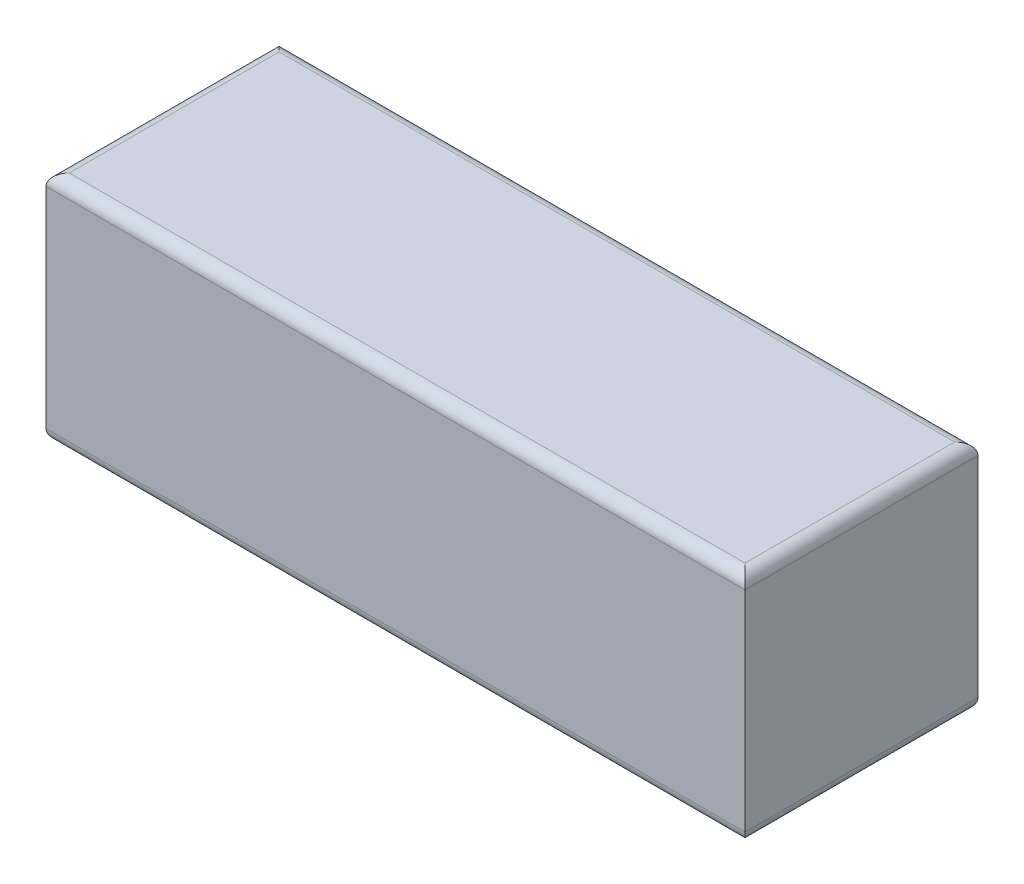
ISO-10303-21;
HEADER;
FILE_DESCRIPTION(('STEP AP214'),'2;1');
FILE_NAME('part.step','',(''),(''),'','','');
FILE_SCHEMA(('AUTOMOTIVE_DESIGN { 1 0 10303 214 1 1 1 1 }'));
ENDSEC;
DATA;
#1=APPLICATION_CONTEXT('core data for automotive mechanical design processes');
#2=APPLICATION_PROTOCOL_DEFINITION('international standard','automotive_design',2000,#1);
#3=PRODUCT_CONTEXT('',#1,'mechanical');
#4=PRODUCT('Part','Part','',(#3));
#5=PRODUCT_RELATED_PRODUCT_CATEGORY('part','',(#4));
#6=PRODUCT_DEFINITION_FORMATION('','',#4);
#7=PRODUCT_DEFINITION_CONTEXT('part definition',#1,'design');
#8=PRODUCT_DEFINITION('design','',#6,#7);
#9=PRODUCT_DEFINITION_SHAPE('','',#8);
#10=(LENGTH_UNIT() NAMED_UNIT(*) SI_UNIT(.MILLI.,.METRE.));
#11=(NAMED_UNIT(*) PLANE_ANGLE_UNIT() SI_UNIT($,.RADIAN.));
#12=(NAMED_UNIT(*) SI_UNIT($,.STERADIAN.) SOLID_ANGLE_UNIT());
#13=UNCERTAINTY_MEASURE_WITH_UNIT(LENGTH_MEASURE(1.E-05),#10,'distance_accuracy_value','');
#14=(GEOMETRIC_REPRESENTATION_CONTEXT(3) GLOBAL_UNCERTAINTY_ASSIGNED_CONTEXT((#13)) GLOBAL_UNIT_ASSIGNED_CONTEXT((#10,
#11,#12)) REPRESENTATION_CONTEXT('',''));
#15=CARTESIAN_POINT('',(0.,0.,0.));
#16=DIRECTION('',(0.,0.,1.));
#17=DIRECTION('',(1.,0.,0.));
#18=AXIS2_PLACEMENT_3D('',#15,#16,#17);
#19=CARTESIAN_POINT('',(0.,20.,0.));
#20=DIRECTION('',(1.,0.,0.));
#21=DIRECTION('',(0.,0.,-1.));
#22=AXIS2_PLACEMENT_3D('',#19,#20,#21);
#23=PLANE('',#22);
#24=DIRECTION('',(0.,-1.,0.));
#25=VECTOR('',#24,1.);
#26=CARTESIAN_POINT('',(0.,20.,-20.));
#27=LINE('',#26,#25);
#28=CARTESIAN_POINT('',(0.,19.,-20.));
#29=VERTEX_POINT('',#28);
#30=CARTESIAN_POINT('',(0.,1.,-20.));
#31=VERTEX_POINT('',#30);
#32=EDGE_CURVE('E158',#29,#31,#27,.T.);
#33=ORIENTED_EDGE('',*,*,#32,.T.);
#34=DIRECTION('',(0.,0.,1.));
#35=VECTOR('',#34,1.);
#36=CARTESIAN_POINT('',(0.,1.,0.));
#37=LINE('',#36,#35);
#38=CARTESIAN_POINT('',(0.,1.,0.));
#39=VERTEX_POINT('',#38);
#40=EDGE_CURVE('E172',#31,#39,#37,.T.);
#41=ORIENTED_EDGE('',*,*,#40,.T.);
#42=DIRECTION('',(0.,-1.,0.));
#43=VECTOR('',#42,1.);
#44=CARTESIAN_POINT('',(0.,20.,0.));
#45=LINE('',#44,#43);
#46=CARTESIAN_POINT('',(0.,19.,0.));
#47=VERTEX_POINT('',#46);
#48=EDGE_CURVE('E129',#47,#39,#45,.T.);
#49=ORIENTED_EDGE('',*,*,#48,.F.);
#50=DIRECTION('',(0.,0.,1.));
#51=VECTOR('',#50,1.);
#52=CARTESIAN_POINT('',(0.,19.,0.));
#53=LINE('',#52,#51);
#54=EDGE_CURVE('E175',#47,#29,#53,.F.);
#55=ORIENTED_EDGE('',*,*,#54,.T.);
#56=EDGE_LOOP('',(#33,#41,#49,#55));
#57=FACE_BOUND('',#56,.T.);
#58=ADVANCED_FACE('F39',(#57),#23,.F.);
#59=CARTESIAN_POINT('',(0.,20.,0.));
#60=DIRECTION('',(0.,0.,-1.));
#61=DIRECTION('',(-1.,0.,0.));
#62=AXIS2_PLACEMENT_3D('',#59,#60,#61);
#63=PLANE('',#62);
#64=ORIENTED_EDGE('',*,*,#48,.T.);
#65=DIRECTION('',(1.,0.,0.));
#66=VECTOR('',#65,1.);
#67=CARTESIAN_POINT('',(60.,1.,0.));
#68=LINE('',#67,#66);
#69=CARTESIAN_POINT('',(60.,1.,0.));
#70=VERTEX_POINT('',#69);
#71=EDGE_CURVE('E127',#39,#70,#68,.T.);
#72=ORIENTED_EDGE('',*,*,#71,.T.);
#73=DIRECTION('',(0.,-1.,0.));
#74=VECTOR('',#73,1.);
#75=CARTESIAN_POINT('',(60.,20.,0.));
#76=LINE('',#75,#74);
#77=CARTESIAN_POINT('',(60.,19.,0.));
#78=VERTEX_POINT('',#77);
#79=EDGE_CURVE('E109',#78,#70,#76,.T.);
#80=ORIENTED_EDGE('',*,*,#79,.F.);
#81=DIRECTION('',(1.,0.,0.));
#82=VECTOR('',#81,1.);
#83=CARTESIAN_POINT('',(0.,19.,0.));
#84=LINE('',#83,#82);
#85=EDGE_CURVE('E124',#78,#47,#84,.F.);
#86=ORIENTED_EDGE('',*,*,#85,.T.);
#87=EDGE_LOOP('',(#64,#72,#80,#86));
#88=FACE_BOUND('',#87,.T.);
#89=ADVANCED_FACE('F123',(#88),#63,.F.);
#90=CARTESIAN_POINT('',(60.,20.,0.));
#91=DIRECTION('',(-1.,0.,0.));
#92=DIRECTION('',(0.,0.,1.));
#93=AXIS2_PLACEMENT_3D('',#90,#91,#92);
#94=PLANE('',#93);
#95=ORIENTED_EDGE('',*,*,#79,.T.);
#96=DIRECTION('',(0.,0.,-1.));
#97=VECTOR('',#96,1.);
#98=CARTESIAN_POINT('',(60.,1.,-20.));
#99=LINE('',#98,#97);
#100=CARTESIAN_POINT('',(60.,1.,-20.));
#101=VERTEX_POINT('',#100);
#102=EDGE_CURVE('E116',#70,#101,#99,.T.);
#103=ORIENTED_EDGE('',*,*,#102,.T.);
#104=DIRECTION('',(0.,-1.,0.));
#105=VECTOR('',#104,1.);
#106=CARTESIAN_POINT('',(60.,20.,-20.));
#107=LINE('',#106,#105);
#108=CARTESIAN_POINT('',(60.,19.,-20.));
#109=VERTEX_POINT('',#108);
#110=EDGE_CURVE('E111',#109,#101,#107,.T.);
#111=ORIENTED_EDGE('',*,*,#110,.F.);
#112=DIRECTION('',(0.,0.,-1.));
#113=VECTOR('',#112,1.);
#114=CARTESIAN_POINT('',(60.,19.,0.));
#115=LINE('',#114,#113);
#116=EDGE_CURVE('E106',#109,#78,#115,.F.);
#117=ORIENTED_EDGE('',*,*,#116,.T.);
#118=EDGE_LOOP('',(#95,#103,#111,#117));
#119=FACE_BOUND('',#118,.T.);
#120=ADVANCED_FACE('F108',(#119),#94,.F.);
#121=CARTESIAN_POINT('',(0.,20.,-20.));
#122=DIRECTION('',(0.,0.,1.));
#123=DIRECTION('',(1.,0.,0.));
#124=AXIS2_PLACEMENT_3D('',#121,#122,#123);
#125=PLANE('',#124);
#126=ORIENTED_EDGE('',*,*,#110,.T.);
#127=DIRECTION('',(-1.,0.,0.));
#128=VECTOR('',#127,1.);
#129=CARTESIAN_POINT('',(0.,1.,-20.));
#130=LINE('',#129,#128);
#131=EDGE_CURVE('E178',#101,#31,#130,.T.);
#132=ORIENTED_EDGE('',*,*,#131,.T.);
#133=ORIENTED_EDGE('',*,*,#32,.F.);
#134=DIRECTION('',(-1.,0.,0.));
#135=VECTOR('',#134,1.);
#136=CARTESIAN_POINT('',(0.,19.,-20.));
#137=LINE('',#136,#135);
#138=EDGE_CURVE('E181',#29,#109,#137,.F.);
#139=ORIENTED_EDGE('',*,*,#138,.T.);
#140=EDGE_LOOP('',(#126,#132,#133,#139));
#141=FACE_BOUND('',#140,.T.);
#142=ADVANCED_FACE('F229',(#141),#125,.F.);
#143=CARTESIAN_POINT('',(0.,20.,0.));
#144=DIRECTION('',(0.,-1.,0.));
#145=DIRECTION('',(0.,0.,-1.));
#146=AXIS2_PLACEMENT_3D('',#143,#144,#145);
#147=PLANE('',#146);
#148=DIRECTION('',(0.,0.,-1.));
#149=VECTOR('',#148,1.);
#150=CARTESIAN_POINT('',(59.,20.,0.));
#151=LINE('',#150,#149);
#152=CARTESIAN_POINT('',(59.,20.,-1.));
#153=VERTEX_POINT('',#152);
#154=CARTESIAN_POINT('',(59.,20.,-19.));
#155=VERTEX_POINT('',#154);
#156=EDGE_CURVE('E49',#153,#155,#151,.T.);
#157=ORIENTED_EDGE('',*,*,#156,.T.);
#158=DIRECTION('',(-1.,0.,0.));
#159=VECTOR('',#158,1.);
#160=CARTESIAN_POINT('',(0.,20.,-19.));
#161=LINE('',#160,#159);
#162=CARTESIAN_POINT('',(1.,20.,-19.));
#163=VERTEX_POINT('',#162);
#164=EDGE_CURVE('E11',#155,#163,#161,.T.);
#165=ORIENTED_EDGE('',*,*,#164,.T.);
#166=DIRECTION('',(0.,0.,1.));
#167=VECTOR('',#166,1.);
#168=CARTESIAN_POINT('',(1.,20.,0.));
#169=LINE('',#168,#167);
#170=CARTESIAN_POINT('',(1.,20.,-1.));
#171=VERTEX_POINT('',#170);
#172=EDGE_CURVE('E169',#163,#171,#169,.T.);
#173=ORIENTED_EDGE('',*,*,#172,.T.);
#174=DIRECTION('',(1.,0.,0.));
#175=VECTOR('',#174,1.);
#176=CARTESIAN_POINT('',(0.,20.,-1.));
#177=LINE('',#176,#175);
#178=EDGE_CURVE('E60',#171,#153,#177,.T.);
#179=ORIENTED_EDGE('',*,*,#178,.T.);
#180=EDGE_LOOP('',(#157,#165,#173,#179));
#181=FACE_BOUND('',#180,.T.);
#182=ADVANCED_FACE('F235',(#181),#147,.F.);
#183=CARTESIAN_POINT('',(0.,0.,0.));
#184=DIRECTION('',(0.,-1.,0.));
#185=DIRECTION('',(0.,0.,-1.));
#186=AXIS2_PLACEMENT_3D('',#183,#184,#185);
#187=PLANE('',#186);
#188=DIRECTION('',(0.,0.,-1.));
#189=VECTOR('',#188,1.);
#190=CARTESIAN_POINT('',(59.,0.,0.));
#191=LINE('',#190,#189);
#192=CARTESIAN_POINT('',(59.,0.,-19.));
#193=VERTEX_POINT('',#192);
#194=CARTESIAN_POINT('',(59.,0.,-1.));
#195=VERTEX_POINT('',#194);
#196=EDGE_CURVE('E189',#193,#195,#191,.F.);
#197=ORIENTED_EDGE('',*,*,#196,.T.);
#198=DIRECTION('',(1.,0.,0.));
#199=VECTOR('',#198,1.);
#200=CARTESIAN_POINT('',(0.,0.,-1.));
#201=LINE('',#200,#199);
#202=CARTESIAN_POINT('',(1.,0.,-1.));
#203=VERTEX_POINT('',#202);
#204=EDGE_CURVE('E117',#195,#203,#201,.F.);
#205=ORIENTED_EDGE('',*,*,#204,.T.);
#206=DIRECTION('',(0.,0.,1.));
#207=VECTOR('',#206,1.);
#208=CARTESIAN_POINT('',(1.,0.,-20.));
#209=LINE('',#208,#207);
#210=CARTESIAN_POINT('',(1.,0.,-19.));
#211=VERTEX_POINT('',#210);
#212=EDGE_CURVE('E195',#203,#211,#209,.F.);
#213=ORIENTED_EDGE('',*,*,#212,.T.);
#214=DIRECTION('',(-1.,0.,0.));
#215=VECTOR('',#214,1.);
#216=CARTESIAN_POINT('',(60.,0.,-19.));
#217=LINE('',#216,#215);
#218=EDGE_CURVE('E192',#211,#193,#217,.F.);
#219=ORIENTED_EDGE('',*,*,#218,.T.);
#220=EDGE_LOOP('',(#197,#205,#213,#219));
#221=FACE_BOUND('',#220,.T.);
#222=ADVANCED_FACE('F237',(#221),#187,.T.);
#223=CARTESIAN_POINT('',(0.,1.,-19.));
#224=DIRECTION('',(1.,0.,0.));
#225=DIRECTION('',(0.,0.,-1.));
#226=AXIS2_PLACEMENT_3D('',#223,#224,#225);
#227=CYLINDRICAL_SURFACE('',#226,1.);
#228=CARTESIAN_POINT('',(59.,1.,-19.));
#229=DIRECTION('',(0.707106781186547,0.,0.707106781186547));
#230=DIRECTION('',(0.707106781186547,0.,-0.707106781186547));
#231=AXIS2_PLACEMENT_3D('',#228,#229,#230);
#232=ELLIPSE('',#231,1.41421356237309,1.);
#233=EDGE_CURVE('E159',#193,#101,#232,.T.);
#234=ORIENTED_EDGE('',*,*,#233,.F.);
#235=ORIENTED_EDGE('',*,*,#218,.F.);
#236=CARTESIAN_POINT('',(1.,1.,-19.));
#237=DIRECTION('',(0.707106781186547,0.,-0.707106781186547));
#238=DIRECTION('',(-0.707106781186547,0.,-0.707106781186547));
#239=AXIS2_PLACEMENT_3D('',#236,#237,#238);
#240=ELLIPSE('',#239,1.41421356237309,1.);
#241=EDGE_CURVE('E154',#31,#211,#240,.F.);
#242=ORIENTED_EDGE('',*,*,#241,.F.);
#243=ORIENTED_EDGE('',*,*,#131,.F.);
#244=EDGE_LOOP('',(#234,#235,#242,#243));
#245=FACE_BOUND('',#244,.T.);
#246=ADVANCED_FACE('F216',(#245),#227,.T.);
#247=CARTESIAN_POINT('',(1.,1.,0.));
#248=DIRECTION('',(0.,0.,-1.));
#249=DIRECTION('',(-1.,0.,0.));
#250=AXIS2_PLACEMENT_3D('',#247,#248,#249);
#251=CYLINDRICAL_SURFACE('',#250,1.);
#252=ORIENTED_EDGE('',*,*,#241,.T.);
#253=ORIENTED_EDGE('',*,*,#212,.F.);
#254=CARTESIAN_POINT('',(1.,1.,-1.));
#255=DIRECTION('',(-0.707106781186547,0.,-0.707106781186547));
#256=DIRECTION('',(0.707106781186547,0.,-0.707106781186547));
#257=AXIS2_PLACEMENT_3D('',#254,#255,#256);
#258=ELLIPSE('',#257,1.41421356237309,1.);
#259=EDGE_CURVE('E143',#39,#203,#258,.F.);
#260=ORIENTED_EDGE('',*,*,#259,.F.);
#261=ORIENTED_EDGE('',*,*,#40,.F.);
#262=EDGE_LOOP('',(#252,#253,#260,#261));
#263=FACE_BOUND('',#262,.T.);
#264=ADVANCED_FACE('F220',(#263),#251,.T.);
#265=CARTESIAN_POINT('',(59.,1.,0.));
#266=DIRECTION('',(0.,0.,1.));
#267=DIRECTION('',(1.,0.,0.));
#268=AXIS2_PLACEMENT_3D('',#265,#266,#267);
#269=CYLINDRICAL_SURFACE('',#268,1.);
#270=ORIENTED_EDGE('',*,*,#233,.T.);
#271=ORIENTED_EDGE('',*,*,#102,.F.);
#272=CARTESIAN_POINT('',(59.,1.,-1.));
#273=DIRECTION('',(-0.707106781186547,0.,0.707106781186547));
#274=DIRECTION('',(0.707106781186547,0.,0.707106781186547));
#275=AXIS2_PLACEMENT_3D('',#272,#273,#274);
#276=ELLIPSE('',#275,1.41421356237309,1.);
#277=EDGE_CURVE('E140',#195,#70,#276,.T.);
#278=ORIENTED_EDGE('',*,*,#277,.F.);
#279=ORIENTED_EDGE('',*,*,#196,.F.);
#280=EDGE_LOOP('',(#270,#271,#278,#279));
#281=FACE_BOUND('',#280,.T.);
#282=ADVANCED_FACE('F228',(#281),#269,.T.);
#283=CARTESIAN_POINT('',(0.,1.,-1.));
#284=DIRECTION('',(-1.,0.,0.));
#285=DIRECTION('',(0.,0.,1.));
#286=AXIS2_PLACEMENT_3D('',#283,#284,#285);
#287=CYLINDRICAL_SURFACE('',#286,1.);
#288=ORIENTED_EDGE('',*,*,#259,.T.);
#289=ORIENTED_EDGE('',*,*,#204,.F.);
#290=ORIENTED_EDGE('',*,*,#277,.T.);
#291=ORIENTED_EDGE('',*,*,#71,.F.);
#292=EDGE_LOOP('',(#288,#289,#290,#291));
#293=FACE_BOUND('',#292,.T.);
#294=ADVANCED_FACE('F223',(#293),#287,.T.);
#295=CARTESIAN_POINT('',(0.,19.,-1.));
#296=DIRECTION('',(1.,0.,0.));
#297=DIRECTION('',(0.,0.,-1.));
#298=AXIS2_PLACEMENT_3D('',#295,#296,#297);
#299=CYLINDRICAL_SURFACE('',#298,1.);
#300=CARTESIAN_POINT('',(1.,19.,-1.));
#301=DIRECTION('',(0.707106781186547,0.,0.707106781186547));
#302=DIRECTION('',(-0.707106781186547,0.,0.707106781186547));
#303=AXIS2_PLACEMENT_3D('',#300,#301,#302);
#304=ELLIPSE('',#303,1.41421356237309,1.);
#305=EDGE_CURVE('E134',#47,#171,#304,.F.);
#306=ORIENTED_EDGE('',*,*,#305,.F.);
#307=ORIENTED_EDGE('',*,*,#85,.F.);
#308=CARTESIAN_POINT('',(59.,19.,-1.));
#309=DIRECTION('',(0.707106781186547,0.,-0.707106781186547));
#310=DIRECTION('',(0.707106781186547,0.,0.707106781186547));
#311=AXIS2_PLACEMENT_3D('',#308,#309,#310);
#312=ELLIPSE('',#311,1.41421356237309,1.);
#313=EDGE_CURVE('E43',#153,#78,#312,.T.);
#314=ORIENTED_EDGE('',*,*,#313,.F.);
#315=ORIENTED_EDGE('',*,*,#178,.F.);
#316=EDGE_LOOP('',(#306,#307,#314,#315));
#317=FACE_BOUND('',#316,.T.);
#318=ADVANCED_FACE('F41',(#317),#299,.T.);
#319=CARTESIAN_POINT('',(59.,19.,0.));
#320=DIRECTION('',(0.,0.,-1.));
#321=DIRECTION('',(-1.,0.,0.));
#322=AXIS2_PLACEMENT_3D('',#319,#320,#321);
#323=CYLINDRICAL_SURFACE('',#322,1.);
#324=ORIENTED_EDGE('',*,*,#313,.T.);
#325=ORIENTED_EDGE('',*,*,#116,.F.);
#326=CARTESIAN_POINT('',(59.,19.,-19.));
#327=DIRECTION('',(-0.707106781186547,0.,-0.707106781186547));
#328=DIRECTION('',(0.707106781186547,0.,-0.707106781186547));
#329=AXIS2_PLACEMENT_3D('',#326,#327,#328);
#330=ELLIPSE('',#329,1.41421356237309,1.);
#331=EDGE_CURVE('E145',#155,#109,#330,.T.);
#332=ORIENTED_EDGE('',*,*,#331,.F.);
#333=ORIENTED_EDGE('',*,*,#156,.F.);
#334=EDGE_LOOP('',(#324,#325,#332,#333));
#335=FACE_BOUND('',#334,.T.);
#336=ADVANCED_FACE('F138',(#335),#323,.T.);
#337=CARTESIAN_POINT('',(1.,19.,0.));
#338=DIRECTION('',(0.,0.,1.));
#339=DIRECTION('',(1.,0.,0.));
#340=AXIS2_PLACEMENT_3D('',#337,#338,#339);
#341=CYLINDRICAL_SURFACE('',#340,1.);
#342=ORIENTED_EDGE('',*,*,#305,.T.);
#343=ORIENTED_EDGE('',*,*,#172,.F.);
#344=CARTESIAN_POINT('',(1.,19.,-19.));
#345=DIRECTION('',(-0.707106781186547,0.,0.707106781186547));
#346=DIRECTION('',(0.707106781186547,0.,0.707106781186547));
#347=AXIS2_PLACEMENT_3D('',#344,#345,#346);
#348=ELLIPSE('',#347,1.41421356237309,1.);
#349=EDGE_CURVE('E149',#29,#163,#348,.F.);
#350=ORIENTED_EDGE('',*,*,#349,.F.);
#351=ORIENTED_EDGE('',*,*,#54,.F.);
#352=EDGE_LOOP('',(#342,#343,#350,#351));
#353=FACE_BOUND('',#352,.T.);
#354=ADVANCED_FACE('F234',(#353),#341,.T.);
#355=CARTESIAN_POINT('',(0.,19.,-19.));
#356=DIRECTION('',(-1.,0.,0.));
#357=DIRECTION('',(0.,0.,1.));
#358=AXIS2_PLACEMENT_3D('',#355,#356,#357);
#359=CYLINDRICAL_SURFACE('',#358,1.);
#360=ORIENTED_EDGE('',*,*,#331,.T.);
#361=ORIENTED_EDGE('',*,*,#138,.F.);
#362=ORIENTED_EDGE('',*,*,#349,.T.);
#363=ORIENTED_EDGE('',*,*,#164,.F.);
#364=EDGE_LOOP('',(#360,#361,#362,#363));
#365=FACE_BOUND('',#364,.T.);
#366=ADVANCED_FACE('F232',(#365),#359,.T.);
#367=CLOSED_SHELL('',(#58,#89,#120,#142,#182,#222,#246,#264,#282,#294,#318,#336,#354,#366));
#368=MANIFOLD_SOLID_BREP('B2',#367);
#369=ADVANCED_BREP_SHAPE_REPRESENTATION('',(#18,#368),#14);
#370=SHAPE_DEFINITION_REPRESENTATION(#9,#369);
ENDSEC;
END-ISO-10303-21;
